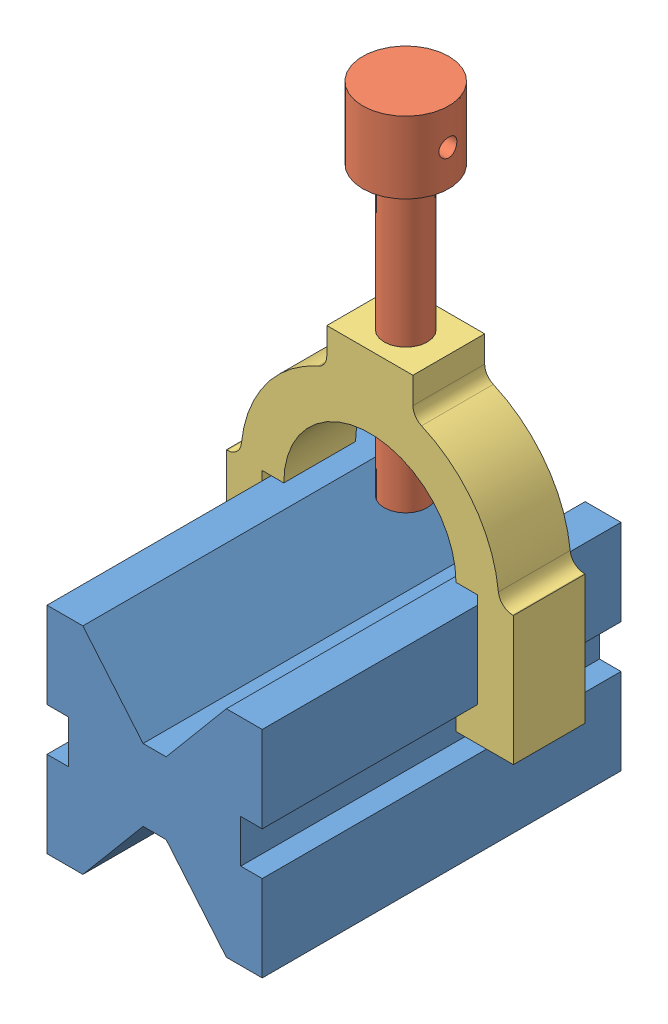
SolidWorks assembly assembly.SLDASM, configuration Default (file format 13000). Lengths in mm.
Overall size (80 166.5 100).
3 component instances, 3 part files, 7 mates.
Components (placement in the parent):
- base-1: base.SLDPRT [Default] at (30 20 -100) size (60 60 100)
- pin-1: pin.SLDPRT [Default] at (30 166.5049 -70) size (24 100 24)
- yoke-1: yoke.SLDPRT [Default] at (30 106.5049 -80) size (80 80 20)
Mates (geometry in assembly coordinates):
- Coincident2: coincident: point of base-1
- Coincident3: coincident anti-aligned: plane of base-1 through (54 24 0) normal (1 0 0); plane of yoke-1 through (54 26.5049 -60) normal (-1 0 0)
- Coincident4: coincident anti-aligned: plane of base-1 through (6 24 0) normal (-1 0 0); plane of yoke-1 through (6 26.5049 -60) normal (1 0 0)
- Coincident5: coincident anti-aligned: plane of base-1 through (60 36 0) normal (1 0 0); plane of yoke-1 through (60 38.5049 -60) normal (-1 0 0)
- Distance3: distance = 60 mm aligned: plane of yoke-1 through (46 99.1655 -60) normal (0 0 1); plane of base-1 through (30 20 0) normal (0 0 1)
- Concentric1: concentric aligned: cylinder of pin-1 through (30 66.5049 -70) axis (0 1 0) radius 6; cylinder of yoke-1 through (30 68.5049 -70) axis (0 1 0) radius 6
- Distance4: distance = 60 mm aligned: plane of pin-1 through (30 166.5049 -70) normal (0 1 0); plane of yoke-1 through (30 106.5049 -60) normal (0 1 0)
